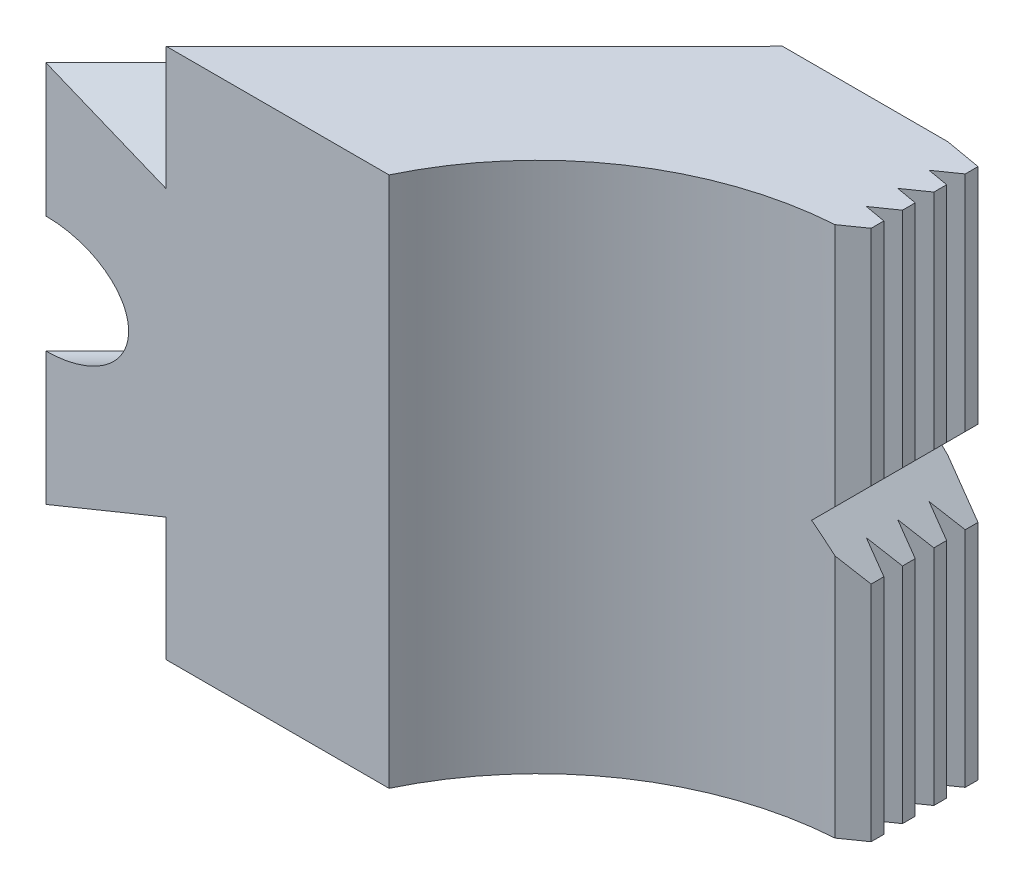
ISO-10303-21;
HEADER;
FILE_DESCRIPTION(('STEP AP214'),'2;1');
FILE_NAME('part.step','',(''),(''),'','','');
FILE_SCHEMA(('AUTOMOTIVE_DESIGN { 1 0 10303 214 1 1 1 1 }'));
ENDSEC;
DATA;
#1=APPLICATION_CONTEXT('core data for automotive mechanical design processes');
#2=APPLICATION_PROTOCOL_DEFINITION('international standard','automotive_design',2000,#1);
#3=PRODUCT_CONTEXT('',#1,'mechanical');
#4=PRODUCT('Part','Part','',(#3));
#5=PRODUCT_RELATED_PRODUCT_CATEGORY('part','',(#4));
#6=PRODUCT_DEFINITION_FORMATION('','',#4);
#7=PRODUCT_DEFINITION_CONTEXT('part definition',#1,'design');
#8=PRODUCT_DEFINITION('design','',#6,#7);
#9=PRODUCT_DEFINITION_SHAPE('','',#8);
#10=(LENGTH_UNIT() NAMED_UNIT(*) SI_UNIT(.MILLI.,.METRE.));
#11=(NAMED_UNIT(*) PLANE_ANGLE_UNIT() SI_UNIT($,.RADIAN.));
#12=(NAMED_UNIT(*) SI_UNIT($,.STERADIAN.) SOLID_ANGLE_UNIT());
#13=UNCERTAINTY_MEASURE_WITH_UNIT(LENGTH_MEASURE(1.E-05),#10,'distance_accuracy_value','');
#14=(GEOMETRIC_REPRESENTATION_CONTEXT(3) GLOBAL_UNCERTAINTY_ASSIGNED_CONTEXT((#13)) GLOBAL_UNIT_ASSIGNED_CONTEXT((#10,
#11,#12)) REPRESENTATION_CONTEXT('',''));
#15=CARTESIAN_POINT('',(0.,0.,0.));
#16=DIRECTION('',(0.,0.,1.));
#17=DIRECTION('',(1.,0.,0.));
#18=AXIS2_PLACEMENT_3D('',#15,#16,#17);
#19=CARTESIAN_POINT('',(-5.99555582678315,1.78618718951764,8.15520176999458));
#20=DIRECTION('',(0.707106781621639,1.45030515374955E-10,-0.707106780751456));
#21=DIRECTION('',(0.666666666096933,0.333333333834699,0.666666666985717));
#22=AXIS2_PLACEMENT_3D('',#19,#20,#21);
#23=PLANE('',#22);
#24=DIRECTION('',(-0.695201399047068,0.182729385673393,-0.695201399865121));
#25=VECTOR('',#24,1.);
#26=CARTESIAN_POINT('',(-5.99555582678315,1.78618718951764,8.15520176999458));
#27=LINE('',#26,#25);
#28=CARTESIAN_POINT('',(-5.99555582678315,1.78618718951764,8.15520176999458));
#29=VERTEX_POINT('',#28);
#30=CARTESIAN_POINT('',(-7.62927911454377,2.21560124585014,6.52147848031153));
#31=VERTEX_POINT('',#30);
#32=EDGE_CURVE('E371',#29,#31,#27,.T.);
#33=ORIENTED_EDGE('',*,*,#32,.T.);
#34=DIRECTION('',(-0.459499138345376,-0.760079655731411,-0.459499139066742));
#35=VECTOR('',#34,1.);
#36=CARTESIAN_POINT('',(-7.62927911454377,2.21560124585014,6.52147848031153));
#37=LINE('',#36,#35);
#38=CARTESIAN_POINT('',(-8.70910208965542,0.42941405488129,5.44165550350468));
#39=VERTEX_POINT('',#38);
#40=EDGE_CURVE('E374',#31,#39,#37,.T.);
#41=ORIENTED_EDGE('',*,*,#40,.T.);
#42=DIRECTION('',(0.235702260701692,-0.942809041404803,0.235702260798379));
#43=VECTOR('',#42,1.);
#44=CARTESIAN_POINT('',(-8.70910208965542,0.42941405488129,5.44165550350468));
#45=LINE('',#44,#43);
#46=CARTESIAN_POINT('',(-8.15520177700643,-1.78618719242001,5.99555581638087));
#47=VERTEX_POINT('',#46);
#48=EDGE_CURVE('E377',#39,#47,#45,.T.);
#49=ORIENTED_EDGE('',*,*,#48,.T.);
#50=DIRECTION('',(0.695201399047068,-0.182729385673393,0.695201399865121));
#51=VECTOR('',#50,1.);
#52=CARTESIAN_POINT('',(-8.15520177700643,-1.78618719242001,5.99555581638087));
#53=LINE('',#52,#51);
#54=CARTESIAN_POINT('',(-6.52147848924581,-2.21560124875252,7.62927910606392));
#55=VERTEX_POINT('',#54);
#56=EDGE_CURVE('E380',#47,#55,#53,.T.);
#57=ORIENTED_EDGE('',*,*,#56,.T.);
#58=DIRECTION('',(0.459499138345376,0.76007965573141,0.459499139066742));
#59=VECTOR('',#58,1.);
#60=CARTESIAN_POINT('',(-6.52147848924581,-2.21560124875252,7.62927910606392));
#61=LINE('',#60,#59);
#62=CARTESIAN_POINT('',(-5.44165551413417,-0.429414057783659,8.70910208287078));
#63=VERTEX_POINT('',#62);
#64=EDGE_CURVE('E383',#55,#63,#61,.T.);
#65=ORIENTED_EDGE('',*,*,#64,.T.);
#66=DIRECTION('',(-0.235702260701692,0.942809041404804,-0.235702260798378));
#67=VECTOR('',#66,1.);
#68=CARTESIAN_POINT('',(-5.44165551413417,-0.429414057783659,8.70910208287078));
#69=LINE('',#68,#67);
#70=EDGE_CURVE('E386',#63,#29,#69,.T.);
#71=ORIENTED_EDGE('',*,*,#70,.T.);
#72=EDGE_LOOP('',(#33,#41,#49,#57,#65,#71));
#73=FACE_BOUND('',#72,.T.);
#74=ADVANCED_FACE('F14',(#73),#23,.F.);
#75=CARTESIAN_POINT('',(-7.62927911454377,2.21560124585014,6.52147848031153));
#76=DIRECTION('',(-0.537457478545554,0.649829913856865,-0.537457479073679));
#77=DIRECTION('',(-0.459499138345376,-0.760079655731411,-0.459499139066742));
#78=AXIS2_PLACEMENT_3D('',#75,#76,#77);
#79=PLANE('',#78);
#80=DIRECTION('',(-0.459499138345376,-0.760079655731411,-0.459499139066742));
#81=VECTOR('',#80,1.);
#82=CARTESIAN_POINT('',(-10.4577062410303,2.21560124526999,9.34990560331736));
#83=LINE('',#82,#81);
#84=CARTESIAN_POINT('',(-10.4577062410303,2.21560124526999,9.34990560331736));
#85=VERTEX_POINT('',#84);
#86=CARTESIAN_POINT('',(-11.537529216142,0.429414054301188,8.27008262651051));
#87=VERTEX_POINT('',#86);
#88=EDGE_CURVE('E356',#85,#87,#83,.T.);
#89=ORIENTED_EDGE('',*,*,#88,.T.);
#90=DIRECTION('',(-0.707106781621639,-1.45030515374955E-10,0.707106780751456));
#91=VECTOR('',#90,1.);
#92=CARTESIAN_POINT('',(-8.70910208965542,0.42941405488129,5.44165550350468));
#93=LINE('',#92,#91);
#94=EDGE_CURVE('E399',#39,#87,#93,.T.);
#95=ORIENTED_EDGE('',*,*,#94,.F.);
#96=ORIENTED_EDGE('',*,*,#40,.F.);
#97=DIRECTION('',(-0.707106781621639,-1.45030515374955E-10,0.707106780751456));
#98=VECTOR('',#97,1.);
#99=CARTESIAN_POINT('',(-7.62927911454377,2.21560124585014,6.52147848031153));
#100=LINE('',#99,#98);
#101=EDGE_CURVE('E389',#31,#85,#100,.T.);
#102=ORIENTED_EDGE('',*,*,#101,.T.);
#103=EDGE_LOOP('',(#89,#95,#96,#102));
#104=FACE_BOUND('',#103,.T.);
#105=ADVANCED_FACE('F425',(#104),#79,.F.);
#106=CARTESIAN_POINT('',(-8.70910208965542,0.42941405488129,5.44165550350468));
#107=DIRECTION('',(-0.666666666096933,-0.3333333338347,-0.666666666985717));
#108=DIRECTION('',(0.235702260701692,-0.942809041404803,0.235702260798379));
#109=AXIS2_PLACEMENT_3D('',#106,#107,#108);
#110=PLANE('',#109);
#111=DIRECTION('',(0.235702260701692,-0.942809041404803,0.235702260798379));
#112=VECTOR('',#111,1.);
#113=CARTESIAN_POINT('',(-11.537529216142,0.429414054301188,8.27008262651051));
#114=LINE('',#113,#112);
#115=CARTESIAN_POINT('',(-10.983628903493,-1.78618719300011,8.8239829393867));
#116=VERTEX_POINT('',#115);
#117=EDGE_CURVE('E359',#87,#116,#114,.T.);
#118=ORIENTED_EDGE('',*,*,#117,.T.);
#119=DIRECTION('',(-0.707106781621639,-1.45030515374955E-10,0.707106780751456));
#120=VECTOR('',#119,1.);
#121=CARTESIAN_POINT('',(-8.15520177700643,-1.78618719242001,5.99555581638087));
#122=LINE('',#121,#120);
#123=EDGE_CURVE('E397',#47,#116,#122,.T.);
#124=ORIENTED_EDGE('',*,*,#123,.F.);
#125=ORIENTED_EDGE('',*,*,#48,.F.);
#126=ORIENTED_EDGE('',*,*,#94,.T.);
#127=EDGE_LOOP('',(#118,#124,#125,#126));
#128=FACE_BOUND('',#127,.T.);
#129=ADVANCED_FACE('F432',(#128),#110,.F.);
#130=CARTESIAN_POINT('',(-8.15520177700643,-1.78618719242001,5.99555581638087));
#131=DIRECTION('',(-0.129209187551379,-0.983163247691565,-0.129209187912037));
#132=DIRECTION('',(0.695201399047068,-0.182729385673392,0.695201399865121));
#133=AXIS2_PLACEMENT_3D('',#130,#131,#132);
#134=PLANE('',#133);
#135=DIRECTION('',(0.695201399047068,-0.182729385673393,0.695201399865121));
#136=VECTOR('',#135,1.);
#137=CARTESIAN_POINT('',(-10.983628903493,-1.78618719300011,8.8239829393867));
#138=LINE('',#137,#136);
#139=CARTESIAN_POINT('',(-9.34990561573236,-2.21560124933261,10.4577062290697));
#140=VERTEX_POINT('',#139);
#141=EDGE_CURVE('E362',#116,#140,#138,.T.);
#142=ORIENTED_EDGE('',*,*,#141,.T.);
#143=DIRECTION('',(-0.707106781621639,-1.45030515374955E-10,0.707106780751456));
#144=VECTOR('',#143,1.);
#145=CARTESIAN_POINT('',(-6.52147848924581,-2.21560124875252,7.62927910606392));
#146=LINE('',#145,#144);
#147=EDGE_CURVE('E395',#55,#140,#146,.T.);
#148=ORIENTED_EDGE('',*,*,#147,.F.);
#149=ORIENTED_EDGE('',*,*,#56,.F.);
#150=ORIENTED_EDGE('',*,*,#123,.T.);
#151=EDGE_LOOP('',(#142,#148,#149,#150));
#152=FACE_BOUND('',#151,.T.);
#153=ADVANCED_FACE('F444',(#152),#134,.F.);
#154=CARTESIAN_POINT('',(-6.52147848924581,-2.21560124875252,7.62927910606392));
#155=DIRECTION('',(0.537457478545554,-0.649829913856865,0.537457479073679));
#156=DIRECTION('',(0.459499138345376,0.760079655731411,0.459499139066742));
#157=AXIS2_PLACEMENT_3D('',#154,#155,#156);
#158=PLANE('',#157);
#159=DIRECTION('',(0.459499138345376,0.76007965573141,0.459499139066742));
#160=VECTOR('',#159,1.);
#161=CARTESIAN_POINT('',(-9.34990561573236,-2.21560124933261,10.4577062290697));
#162=LINE('',#161,#160);
#163=CARTESIAN_POINT('',(-8.27008264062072,-0.429414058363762,11.5375292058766));
#164=VERTEX_POINT('',#163);
#165=EDGE_CURVE('E365',#140,#164,#162,.T.);
#166=ORIENTED_EDGE('',*,*,#165,.T.);
#167=DIRECTION('',(-0.707106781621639,-1.45030515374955E-10,0.707106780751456));
#168=VECTOR('',#167,1.);
#169=CARTESIAN_POINT('',(-5.44165551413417,-0.429414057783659,8.70910208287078));
#170=LINE('',#169,#168);
#171=EDGE_CURVE('E393',#63,#164,#170,.T.);
#172=ORIENTED_EDGE('',*,*,#171,.F.);
#173=ORIENTED_EDGE('',*,*,#64,.F.);
#174=ORIENTED_EDGE('',*,*,#147,.T.);
#175=EDGE_LOOP('',(#166,#172,#173,#174));
#176=FACE_BOUND('',#175,.T.);
#177=ADVANCED_FACE('F440',(#176),#158,.F.);
#178=CARTESIAN_POINT('',(-5.44165551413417,-0.429414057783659,8.70910208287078));
#179=DIRECTION('',(0.666666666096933,0.333333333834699,0.666666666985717));
#180=DIRECTION('',(-0.707106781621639,-1.45030515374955E-10,0.707106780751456));
#181=AXIS2_PLACEMENT_3D('',#178,#179,#180);
#182=PLANE('',#181);
#183=DIRECTION('',(-0.235702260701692,0.942809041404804,-0.235702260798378));
#184=VECTOR('',#183,1.);
#185=CARTESIAN_POINT('',(-8.27008264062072,-0.429414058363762,11.5375292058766));
#186=LINE('',#185,#184);
#187=CARTESIAN_POINT('',(-8.8239829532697,1.78618718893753,10.9836288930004));
#188=VERTEX_POINT('',#187);
#189=EDGE_CURVE('E368',#164,#188,#186,.T.);
#190=ORIENTED_EDGE('',*,*,#189,.T.);
#191=DIRECTION('',(-0.707106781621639,-1.45030515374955E-10,0.707106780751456));
#192=VECTOR('',#191,1.);
#193=CARTESIAN_POINT('',(-5.99555582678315,1.78618718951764,8.15520176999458));
#194=LINE('',#193,#192);
#195=EDGE_CURVE('E390',#29,#188,#194,.T.);
#196=ORIENTED_EDGE('',*,*,#195,.F.);
#197=ORIENTED_EDGE('',*,*,#70,.F.);
#198=ORIENTED_EDGE('',*,*,#171,.T.);
#199=EDGE_LOOP('',(#190,#196,#197,#198));
#200=FACE_BOUND('',#199,.T.);
#201=ADVANCED_FACE('F421',(#200),#182,.F.);
#202=CARTESIAN_POINT('',(-5.99555582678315,1.78618718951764,8.15520176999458));
#203=DIRECTION('',(0.129209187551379,0.983163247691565,0.129209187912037));
#204=DIRECTION('',(-0.695201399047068,0.182729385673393,-0.695201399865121));
#205=AXIS2_PLACEMENT_3D('',#202,#203,#204);
#206=PLANE('',#205);
#207=DIRECTION('',(-0.695201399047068,0.182729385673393,-0.695201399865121));
#208=VECTOR('',#207,1.);
#209=CARTESIAN_POINT('',(-8.8239829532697,1.78618718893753,10.9836288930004));
#210=LINE('',#209,#208);
#211=EDGE_CURVE('E354',#188,#85,#210,.T.);
#212=ORIENTED_EDGE('',*,*,#211,.T.);
#213=ORIENTED_EDGE('',*,*,#101,.F.);
#214=ORIENTED_EDGE('',*,*,#32,.F.);
#215=ORIENTED_EDGE('',*,*,#195,.T.);
#216=EDGE_LOOP('',(#212,#213,#214,#215));
#217=FACE_BOUND('',#216,.T.);
#218=ADVANCED_FACE('F413',(#217),#206,.F.);
#219=CARTESIAN_POINT('',(-2.83273811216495,-5.81010933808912E-10,2.83273810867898));
#220=DIRECTION('',(-0.707106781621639,-1.45030515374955E-10,0.707106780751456));
#221=DIRECTION('',(-0.666666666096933,-0.333333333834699,-0.666666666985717));
#222=AXIS2_PLACEMENT_3D('',#219,#220,#221);
#223=PLANE('',#222);
#224=CARTESIAN_POINT('',(-2.83273811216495,-5.81010933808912E-10,2.83273810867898));
#225=DIRECTION('',(-0.707106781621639,-1.45030515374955E-10,0.707106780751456));
#226=DIRECTION('',(-0.666666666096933,-0.333333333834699,-0.666666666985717));
#227=AXIS2_PLACEMENT_3D('',#224,#225,#226);
#228=CIRCLE('',#227,5.);
#229=CARTESIAN_POINT('',(-2.83273811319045,4.99999999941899,2.83273810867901));
#230=VERTEX_POINT('',#229);
#231=CARTESIAN_POINT('',(-2.83273811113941,-5.00000000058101,2.832738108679));
#232=VERTEX_POINT('',#231);
#233=EDGE_CURVE('E392',#230,#232,#228,.T.);
#234=ORIENTED_EDGE('',*,*,#233,.F.);
#235=DIRECTION('',(2.05103737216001E-10,-1.,0.));
#236=VECTOR('',#235,1.);
#237=CARTESIAN_POINT('',(-2.83273810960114,-12.500000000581,2.83273810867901));
#238=LINE('',#237,#236);
#239=EDGE_CURVE('E341',#230,#232,#238,.T.);
#240=ORIENTED_EDGE('',*,*,#239,.T.);
#241=EDGE_LOOP('',(#234,#240));
#242=FACE_BOUND('',#241,.T.);
#243=ADVANCED_FACE('F411',(#242),#223,.F.);
#244=CARTESIAN_POINT('',(-9.90380592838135,-2.03131261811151E-09,9.90380591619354));
#245=DIRECTION('',(-0.707106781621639,-1.45030515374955E-10,0.707106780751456));
#246=DIRECTION('',(-0.666666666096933,-0.333333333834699,-0.666666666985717));
#247=AXIS2_PLACEMENT_3D('',#244,#245,#246);
#248=PLANE('',#247);
#249=DIRECTION('',(2.05103737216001E-10,-1.,0.));
#250=VECTOR('',#249,1.);
#251=CARTESIAN_POINT('',(-9.90380592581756,-12.5000000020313,9.90380591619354));
#252=LINE('',#251,#250);
#253=CARTESIAN_POINT('',(-9.90380592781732,-2.75000000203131,9.90380591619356));
#254=VERTEX_POINT('',#253);
#255=CARTESIAN_POINT('',(-9.90380592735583,-5.00000000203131,9.90380591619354));
#256=VERTEX_POINT('',#255);
#257=EDGE_CURVE('E31',#254,#256,#252,.T.);
#258=ORIENTED_EDGE('',*,*,#257,.F.);
#259=CARTESIAN_POINT('',(-9.90380592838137,-2.03131261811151E-09,9.90380591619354));
#260=DIRECTION('',(-0.707106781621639,-1.45030328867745E-10,0.707106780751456));
#261=DIRECTION('',(0.707106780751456,1.45030315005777E-10,0.707106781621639));
#262=AXIS2_PLACEMENT_3D('',#259,#260,#261);
#263=CIRCLE('',#262,2.75);
#264=CARTESIAN_POINT('',(-9.90380592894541,2.74999999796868,9.90380591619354));
#265=VERTEX_POINT('',#264);
#266=EDGE_CURVE('E872',#254,#265,#263,.T.);
#267=ORIENTED_EDGE('',*,*,#266,.T.);
#268=CARTESIAN_POINT('',(-9.90380592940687,4.99999999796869,9.90380591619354));
#269=VERTEX_POINT('',#268);
#270=EDGE_CURVE('E39',#269,#265,#252,.T.);
#271=ORIENTED_EDGE('',*,*,#270,.F.);
#272=CARTESIAN_POINT('',(-9.90380592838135,-2.03131261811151E-09,9.90380591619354));
#273=DIRECTION('',(-0.707106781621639,-1.45030515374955E-10,0.707106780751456));
#274=DIRECTION('',(-0.666666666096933,-0.333333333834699,-0.666666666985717));
#275=AXIS2_PLACEMENT_3D('',#272,#273,#274);
#276=CIRCLE('',#275,5.);
#277=EDGE_CURVE('E18',#269,#256,#276,.T.);
#278=ORIENTED_EDGE('',*,*,#277,.T.);
#279=EDGE_LOOP('',(#258,#267,#271,#278));
#280=FACE_BOUND('',#279,.T.);
#281=ORIENTED_EDGE('',*,*,#211,.F.);
#282=ORIENTED_EDGE('',*,*,#189,.F.);
#283=ORIENTED_EDGE('',*,*,#165,.F.);
#284=ORIENTED_EDGE('',*,*,#141,.F.);
#285=ORIENTED_EDGE('',*,*,#117,.F.);
#286=ORIENTED_EDGE('',*,*,#88,.F.);
#287=EDGE_LOOP('',(#281,#282,#283,#284,#285,#286));
#288=FACE_BOUND('',#287,.T.);
#289=ADVANCED_FACE('F407',(#280,#288),#248,.T.);
#290=CARTESIAN_POINT('',(-9.90380592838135,-2.03131261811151E-09,9.90380591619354));
#291=DIRECTION('',(0.707106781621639,1.45030515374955E-10,-0.707106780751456));
#292=DIRECTION('',(0.666666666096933,0.333333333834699,0.666666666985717));
#293=AXIS2_PLACEMENT_3D('',#290,#291,#292);
#294=CYLINDRICAL_SURFACE('',#293,5.);
#295=DIRECTION('',(-0.707106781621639,-1.45030328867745E-10,0.707106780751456));
#296=VECTOR('',#295,1.);
#297=CARTESIAN_POINT('',(-2.83273811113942,-5.00000000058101,2.83273810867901));
#298=LINE('',#297,#296);
#299=EDGE_CURVE('E9',#256,#232,#298,.F.);
#300=ORIENTED_EDGE('',*,*,#299,.F.);
#301=ORIENTED_EDGE('',*,*,#277,.F.);
#302=DIRECTION('',(-0.707106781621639,-1.45030328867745E-10,0.707106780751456));
#303=VECTOR('',#302,1.);
#304=CARTESIAN_POINT('',(-2.83273811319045,4.99999999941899,2.83273810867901));
#305=LINE('',#304,#303);
#306=EDGE_CURVE('E23',#230,#269,#305,.T.);
#307=ORIENTED_EDGE('',*,*,#306,.F.);
#308=ORIENTED_EDGE('',*,*,#233,.T.);
#309=EDGE_LOOP('',(#300,#301,#307,#308));
#310=FACE_BOUND('',#309,.T.);
#311=ADVANCED_FACE('F16',(#310),#294,.T.);
#312=CARTESIAN_POINT('',(15.1599999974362,12.5000000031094,9.32810079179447E-09));
#313=DIRECTION('',(-1.,-2.05103893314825E-10,-6.15310263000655E-10));
#314=DIRECTION('',(2.05103782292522E-10,-1.,0.));
#315=AXIS2_PLACEMENT_3D('',#312,#313,#314);
#316=PLANE('',#315);
#317=DIRECTION('',(6.15310540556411E-10,0.,-1.));
#318=VECTOR('',#317,1.);
#319=CARTESIAN_POINT('',(15.1599999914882,-1.99999999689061,14.5000000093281));
#320=LINE('',#319,#318);
#321=CARTESIAN_POINT('',(15.1599999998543,-1.99999999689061,0.90355936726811));
#322=VERTEX_POINT('',#321);
#323=CARTESIAN_POINT('',(15.1600000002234,-1.99999999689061,0.303559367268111));
#324=VERTEX_POINT('',#323);
#325=EDGE_CURVE('E885',#322,#324,#320,.T.);
#326=ORIENTED_EDGE('',*,*,#325,.F.);
#327=DIRECTION('',(-2.05103782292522E-10,1.,0.));
#328=VECTOR('',#327,1.);
#329=CARTESIAN_POINT('',(15.1600000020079,-12.4999999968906,0.90355936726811));
#330=LINE('',#329,#328);
#331=CARTESIAN_POINT('',(15.1600000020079,-12.4999999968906,0.90355936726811));
#332=VERTEX_POINT('',#331);
#333=EDGE_CURVE('E1011',#332,#322,#330,.T.);
#334=ORIENTED_EDGE('',*,*,#333,.F.);
#335=DIRECTION('',(6.15310540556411E-10,0.,-1.));
#336=VECTOR('',#335,1.);
#337=CARTESIAN_POINT('',(15.1600000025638,-12.4999999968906,9.32809558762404E-09));
#338=LINE('',#337,#336);
#339=CARTESIAN_POINT('',(15.160000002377,-12.4999999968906,0.303559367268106));
#340=VERTEX_POINT('',#339);
#341=EDGE_CURVE('E1034',#332,#340,#338,.T.);
#342=ORIENTED_EDGE('',*,*,#341,.T.);
#343=DIRECTION('',(-2.05103782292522E-10,1.,0.));
#344=VECTOR('',#343,1.);
#345=CARTESIAN_POINT('',(15.160000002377,-12.4999999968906,0.303559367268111));
#346=LINE('',#345,#344);
#347=EDGE_CURVE('E1015',#340,#324,#346,.T.);
#348=ORIENTED_EDGE('',*,*,#347,.T.);
#349=EDGE_LOOP('',(#326,#334,#342,#348));
#350=FACE_BOUND('',#349,.T.);
#351=ADVANCED_FACE('F524',(#350),#316,.F.);
#352=CARTESIAN_POINT('',(14.160000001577,-12.4999999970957,1.60376690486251));
#353=DIRECTION('',(-0.573576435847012,-1.17642715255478E-10,-0.81915204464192));
#354=DIRECTION('',(-0.81915204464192,-1.68011304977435E-10,0.573576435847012));
#355=AXIS2_PLACEMENT_3D('',#352,#353,#354);
#356=PLANE('',#355);
#357=DIRECTION('',(0.633687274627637,-0.633687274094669,-0.443712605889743));
#358=VECTOR('',#357,1.);
#359=CARTESIAN_POINT('',(18.777934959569,-5.61793495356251,-1.6297459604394));
#360=LINE('',#359,#358);
#361=CARTESIAN_POINT('',(14.1599999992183,-0.999999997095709,1.60376690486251));
#362=VERTEX_POINT('',#361);
#363=EDGE_CURVE('E904',#362,#322,#360,.T.);
#364=ORIENTED_EDGE('',*,*,#363,.F.);
#365=DIRECTION('',(-2.05103782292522E-10,1.,0.));
#366=VECTOR('',#365,1.);
#367=CARTESIAN_POINT('',(14.160000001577,-12.4999999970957,1.60376690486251));
#368=LINE('',#367,#366);
#369=CARTESIAN_POINT('',(14.160000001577,-12.4999999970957,1.60376690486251));
#370=VERTEX_POINT('',#369);
#371=EDGE_CURVE('E1007',#370,#362,#368,.T.);
#372=ORIENTED_EDGE('',*,*,#371,.F.);
#373=DIRECTION('',(-0.81915204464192,-1.68011304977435E-10,0.573576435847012));
#374=VECTOR('',#373,1.);
#375=CARTESIAN_POINT('',(14.160000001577,-12.4999999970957,1.60376690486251));
#376=LINE('',#375,#374);
#377=EDGE_CURVE('E959',#332,#370,#376,.T.);
#378=ORIENTED_EDGE('',*,*,#377,.F.);
#379=ORIENTED_EDGE('',*,*,#333,.T.);
#380=EDGE_LOOP('',(#364,#372,#378,#379));
#381=FACE_BOUND('',#380,.T.);
#382=ADVANCED_FACE('F530',(#381),#356,.F.);
#383=CARTESIAN_POINT('',(15.1600000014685,-12.4999999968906,1.78009388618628));
#384=DIRECTION('',(-0.173648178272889,-3.56159713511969E-11,0.984807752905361));
#385=DIRECTION('',(0.984807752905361,2.01987894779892E-10,0.173648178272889));
#386=AXIS2_PLACEMENT_3D('',#383,#384,#385);
#387=PLANE('',#386);
#388=DIRECTION('',(-0.701673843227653,0.701673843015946,-0.123724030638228));
#389=VECTOR('',#388,1.);
#390=CARTESIAN_POINT('',(20.329634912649,-7.16963490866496,2.6916400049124));
#391=LINE('',#390,#389);
#392=CARTESIAN_POINT('',(15.1599999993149,-1.99999999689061,1.78009388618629));
#393=VERTEX_POINT('',#392);
#394=EDGE_CURVE('E902',#393,#362,#391,.T.);
#395=ORIENTED_EDGE('',*,*,#394,.F.);
#396=DIRECTION('',(-2.05103782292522E-10,1.,0.));
#397=VECTOR('',#396,1.);
#398=CARTESIAN_POINT('',(15.1600000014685,-12.4999999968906,1.78009388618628));
#399=LINE('',#398,#397);
#400=CARTESIAN_POINT('',(15.1600000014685,-12.4999999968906,1.78009388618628));
#401=VERTEX_POINT('',#400);
#402=EDGE_CURVE('E1003',#401,#393,#399,.T.);
#403=ORIENTED_EDGE('',*,*,#402,.F.);
#404=DIRECTION('',(0.984807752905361,2.01987894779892E-10,0.173648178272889));
#405=VECTOR('',#404,1.);
#406=CARTESIAN_POINT('',(15.1600000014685,-12.4999999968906,1.78009388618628));
#407=LINE('',#406,#405);
#408=EDGE_CURVE('E962',#370,#401,#407,.T.);
#409=ORIENTED_EDGE('',*,*,#408,.F.);
#410=ORIENTED_EDGE('',*,*,#371,.T.);
#411=EDGE_LOOP('',(#395,#403,#409,#410));
#412=FACE_BOUND('',#411,.T.);
#413=ADVANCED_FACE('F542',(#412),#387,.F.);
#414=CARTESIAN_POINT('',(15.1599999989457,-1.99999999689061,2.38009388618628));
#415=VERTEX_POINT('',#414);
#416=EDGE_CURVE('E887',#415,#393,#320,.T.);
#417=ORIENTED_EDGE('',*,*,#416,.F.);
#418=DIRECTION('',(-2.05103782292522E-10,1.,0.));
#419=VECTOR('',#418,1.);
#420=CARTESIAN_POINT('',(15.1600000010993,-12.4999999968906,2.38009388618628));
#421=LINE('',#420,#419);
#422=CARTESIAN_POINT('',(15.1600000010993,-12.4999999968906,2.38009388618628));
#423=VERTEX_POINT('',#422);
#424=EDGE_CURVE('E999',#423,#415,#421,.T.);
#425=ORIENTED_EDGE('',*,*,#424,.F.);
#426=EDGE_CURVE('E1037',#423,#401,#338,.T.);
#427=ORIENTED_EDGE('',*,*,#426,.T.);
#428=ORIENTED_EDGE('',*,*,#402,.T.);
#429=EDGE_LOOP('',(#417,#425,#427,#428));
#430=FACE_BOUND('',#429,.T.);
#431=ADVANCED_FACE('F553',(#430),#316,.F.);
#432=CARTESIAN_POINT('',(14.1600000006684,-12.4999999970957,3.08030142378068));
#433=DIRECTION('',(-0.573576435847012,-1.17642715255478E-10,-0.819152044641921));
#434=DIRECTION('',(-0.819152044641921,-1.68011304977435E-10,0.573576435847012));
#435=AXIS2_PLACEMENT_3D('',#432,#433,#434);
#436=PLANE('',#435);
#437=DIRECTION('',(0.633687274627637,-0.633687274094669,-0.443712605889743));
#438=VECTOR('',#437,1.);
#439=CARTESIAN_POINT('',(18.7779349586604,-5.61793495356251,-0.15321144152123));
#440=LINE('',#439,#438);
#441=CARTESIAN_POINT('',(14.1599999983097,-0.999999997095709,3.08030142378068));
#442=VERTEX_POINT('',#441);
#443=EDGE_CURVE('E900',#442,#415,#440,.T.);
#444=ORIENTED_EDGE('',*,*,#443,.F.);
#445=DIRECTION('',(-2.05103782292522E-10,1.,0.));
#446=VECTOR('',#445,1.);
#447=CARTESIAN_POINT('',(14.1600000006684,-12.4999999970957,3.08030142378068));
#448=LINE('',#447,#446);
#449=CARTESIAN_POINT('',(14.1600000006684,-12.4999999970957,3.08030142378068));
#450=VERTEX_POINT('',#449);
#451=EDGE_CURVE('E995',#450,#442,#448,.T.);
#452=ORIENTED_EDGE('',*,*,#451,.F.);
#453=DIRECTION('',(-0.819152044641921,-1.68011304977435E-10,0.573576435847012));
#454=VECTOR('',#453,1.);
#455=CARTESIAN_POINT('',(14.1600000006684,-12.4999999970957,3.08030142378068));
#456=LINE('',#455,#454);
#457=EDGE_CURVE('E965',#423,#450,#456,.T.);
#458=ORIENTED_EDGE('',*,*,#457,.F.);
#459=ORIENTED_EDGE('',*,*,#424,.T.);
#460=EDGE_LOOP('',(#444,#452,#458,#459));
#461=FACE_BOUND('',#460,.T.);
#462=ADVANCED_FACE('F563',(#461),#436,.F.);
#463=CARTESIAN_POINT('',(15.1600000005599,-12.4999999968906,3.25662840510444));
#464=DIRECTION('',(-0.173648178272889,-3.56159713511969E-11,0.984807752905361));
#465=DIRECTION('',(0.984807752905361,2.01987894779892E-10,0.173648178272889));
#466=AXIS2_PLACEMENT_3D('',#463,#464,#465);
#467=PLANE('',#466);
#468=DIRECTION('',(-0.701673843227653,0.701673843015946,-0.123724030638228));
#469=VECTOR('',#468,1.);
#470=CARTESIAN_POINT('',(20.3296349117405,-7.16963490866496,4.16817452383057));
#471=LINE('',#470,#469);
#472=CARTESIAN_POINT('',(15.1599999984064,-1.99999999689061,3.25662840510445));
#473=VERTEX_POINT('',#472);
#474=EDGE_CURVE('E898',#473,#442,#471,.T.);
#475=ORIENTED_EDGE('',*,*,#474,.F.);
#476=DIRECTION('',(-2.05103782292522E-10,1.,0.));
#477=VECTOR('',#476,1.);
#478=CARTESIAN_POINT('',(15.1600000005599,-12.4999999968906,3.25662840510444));
#479=LINE('',#478,#477);
#480=CARTESIAN_POINT('',(15.1600000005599,-12.4999999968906,3.25662840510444));
#481=VERTEX_POINT('',#480);
#482=EDGE_CURVE('E991',#481,#473,#479,.T.);
#483=ORIENTED_EDGE('',*,*,#482,.F.);
#484=DIRECTION('',(0.984807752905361,2.01987894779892E-10,0.173648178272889));
#485=VECTOR('',#484,1.);
#486=CARTESIAN_POINT('',(15.1600000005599,-12.4999999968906,3.25662840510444));
#487=LINE('',#486,#485);
#488=EDGE_CURVE('E968',#450,#481,#487,.T.);
#489=ORIENTED_EDGE('',*,*,#488,.F.);
#490=ORIENTED_EDGE('',*,*,#451,.T.);
#491=EDGE_LOOP('',(#475,#483,#489,#490));
#492=FACE_BOUND('',#491,.T.);
#493=ADVANCED_FACE('F573',(#492),#467,.F.);
#494=CARTESIAN_POINT('',(15.1599999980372,-1.99999999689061,3.85662840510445));
#495=VERTEX_POINT('',#494);
#496=EDGE_CURVE('E1140',#495,#473,#320,.T.);
#497=ORIENTED_EDGE('',*,*,#496,.F.);
#498=DIRECTION('',(-2.05103782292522E-10,1.,0.));
#499=VECTOR('',#498,1.);
#500=CARTESIAN_POINT('',(15.1600000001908,-12.4999999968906,3.85662840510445));
#501=LINE('',#500,#499);
#502=CARTESIAN_POINT('',(15.1600000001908,-12.4999999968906,3.85662840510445));
#503=VERTEX_POINT('',#502);
#504=EDGE_CURVE('E987',#503,#495,#501,.T.);
#505=ORIENTED_EDGE('',*,*,#504,.F.);
#506=EDGE_CURVE('E1128',#503,#481,#338,.T.);
#507=ORIENTED_EDGE('',*,*,#506,.T.);
#508=ORIENTED_EDGE('',*,*,#482,.T.);
#509=EDGE_LOOP('',(#497,#505,#507,#508));
#510=FACE_BOUND('',#509,.T.);
#511=ADVANCED_FACE('F583',(#510),#316,.F.);
#512=CARTESIAN_POINT('',(14.1599999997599,-12.4999999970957,4.55683594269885));
#513=DIRECTION('',(-0.573576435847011,-1.17642715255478E-10,-0.819152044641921));
#514=DIRECTION('',(-0.819152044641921,-1.68011304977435E-10,0.573576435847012));
#515=AXIS2_PLACEMENT_3D('',#512,#513,#514);
#516=PLANE('',#515);
#517=DIRECTION('',(0.633687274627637,-0.633687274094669,-0.443712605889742));
#518=VECTOR('',#517,1.);
#519=CARTESIAN_POINT('',(18.7779349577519,-5.61793495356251,1.32332307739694));
#520=LINE('',#519,#518);
#521=CARTESIAN_POINT('',(14.1599999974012,-0.999999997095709,4.55683594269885));
#522=VERTEX_POINT('',#521);
#523=EDGE_CURVE('E326',#522,#495,#520,.T.);
#524=ORIENTED_EDGE('',*,*,#523,.F.);
#525=DIRECTION('',(-2.05103782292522E-10,1.,0.));
#526=VECTOR('',#525,1.);
#527=CARTESIAN_POINT('',(14.1599999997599,-12.4999999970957,4.55683594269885));
#528=LINE('',#527,#526);
#529=CARTESIAN_POINT('',(14.1599999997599,-12.4999999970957,4.55683594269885));
#530=VERTEX_POINT('',#529);
#531=EDGE_CURVE('E983',#530,#522,#528,.T.);
#532=ORIENTED_EDGE('',*,*,#531,.F.);
#533=DIRECTION('',(-0.819152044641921,-1.68011304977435E-10,0.573576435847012));
#534=VECTOR('',#533,1.);
#535=CARTESIAN_POINT('',(14.1599999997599,-12.4999999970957,4.55683594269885));
#536=LINE('',#535,#534);
#537=EDGE_CURVE('E971',#503,#530,#536,.T.);
#538=ORIENTED_EDGE('',*,*,#537,.F.);
#539=ORIENTED_EDGE('',*,*,#504,.T.);
#540=EDGE_LOOP('',(#524,#532,#538,#539));
#541=FACE_BOUND('',#540,.T.);
#542=ADVANCED_FACE('F593',(#541),#516,.F.);
#543=CARTESIAN_POINT('',(15.1599999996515,-12.4999999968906,4.73316292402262));
#544=DIRECTION('',(-0.17364817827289,-3.56159713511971E-11,0.984807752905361));
#545=DIRECTION('',(0.984807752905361,2.01987894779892E-10,0.17364817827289));
#546=AXIS2_PLACEMENT_3D('',#543,#544,#545);
#547=PLANE('',#546);
#548=DIRECTION('',(-0.701673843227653,0.701673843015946,-0.123724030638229));
#549=VECTOR('',#548,1.);
#550=CARTESIAN_POINT('',(20.3296349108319,-7.16963490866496,5.64470904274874));
#551=LINE('',#550,#549);
#552=CARTESIAN_POINT('',(15.1599999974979,-1.99999999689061,4.73316292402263));
#553=VERTEX_POINT('',#552);
#554=EDGE_CURVE('E896',#553,#522,#551,.T.);
#555=ORIENTED_EDGE('',*,*,#554,.F.);
#556=DIRECTION('',(-2.05103782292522E-10,1.,0.));
#557=VECTOR('',#556,1.);
#558=CARTESIAN_POINT('',(15.1599999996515,-12.4999999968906,4.73316292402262));
#559=LINE('',#558,#557);
#560=CARTESIAN_POINT('',(15.1599999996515,-12.4999999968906,4.73316292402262));
#561=VERTEX_POINT('',#560);
#562=EDGE_CURVE('E978',#561,#553,#559,.T.);
#563=ORIENTED_EDGE('',*,*,#562,.F.);
#564=DIRECTION('',(0.984807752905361,2.01987894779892E-10,0.17364817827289));
#565=VECTOR('',#564,1.);
#566=CARTESIAN_POINT('',(15.1599999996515,-12.4999999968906,4.73316292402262));
#567=LINE('',#566,#565);
#568=EDGE_CURVE('E974',#530,#561,#567,.T.);
#569=ORIENTED_EDGE('',*,*,#568,.F.);
#570=ORIENTED_EDGE('',*,*,#531,.T.);
#571=EDGE_LOOP('',(#555,#563,#569,#570));
#572=FACE_BOUND('',#571,.T.);
#573=ADVANCED_FACE('F602',(#572),#547,.F.);
#574=CARTESIAN_POINT('',(15.1599999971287,-1.99999999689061,5.33316292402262));
#575=VERTEX_POINT('',#574);
#576=EDGE_CURVE('E888',#575,#553,#320,.T.);
#577=ORIENTED_EDGE('',*,*,#576,.F.);
#578=DIRECTION('',(-2.05103782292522E-10,1.,0.));
#579=VECTOR('',#578,1.);
#580=CARTESIAN_POINT('',(15.1599999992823,-12.4999999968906,5.33316292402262));
#581=LINE('',#580,#579);
#582=CARTESIAN_POINT('',(15.1599999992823,-12.4999999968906,5.33316292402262));
#583=VERTEX_POINT('',#582);
#584=EDGE_CURVE('E1027',#583,#575,#581,.T.);
#585=ORIENTED_EDGE('',*,*,#584,.F.);
#586=EDGE_CURVE('E1038',#583,#561,#338,.T.);
#587=ORIENTED_EDGE('',*,*,#586,.T.);
#588=ORIENTED_EDGE('',*,*,#562,.T.);
#589=EDGE_LOOP('',(#577,#585,#587,#588));
#590=FACE_BOUND('',#589,.T.);
#591=ADVANCED_FACE('F613',(#590),#316,.F.);
#592=CARTESIAN_POINT('',(15.1599999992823,-12.4999999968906,5.33316292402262));
#593=DIRECTION('',(-0.573576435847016,-1.17642715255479E-10,-0.819152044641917));
#594=DIRECTION('',(-0.819152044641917,-1.68011304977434E-10,0.573576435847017));
#595=AXIS2_PLACEMENT_3D('',#592,#593,#594);
#596=PLANE('',#595);
#597=DIRECTION('',(0.633687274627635,-0.633687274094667,-0.443712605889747));
#598=VECTOR('',#597,1.);
#599=CARTESIAN_POINT('',(19.3763753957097,-6.21637539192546,2.38082509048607));
#600=LINE('',#599,#598);
#601=CARTESIAN_POINT('',(14.1599999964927,-0.999999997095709,6.03337046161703));
#602=VERTEX_POINT('',#601);
#603=EDGE_CURVE('E908',#602,#575,#600,.T.);
#604=ORIENTED_EDGE('',*,*,#603,.F.);
#605=DIRECTION('',(-2.05103782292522E-10,1.,0.));
#606=VECTOR('',#605,1.);
#607=CARTESIAN_POINT('',(14.1599999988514,-12.4999999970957,6.03337046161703));
#608=LINE('',#607,#606);
#609=CARTESIAN_POINT('',(14.1599999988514,-12.4999999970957,6.03337046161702));
#610=VERTEX_POINT('',#609);
#611=EDGE_CURVE('E1023',#610,#602,#608,.T.);
#612=ORIENTED_EDGE('',*,*,#611,.F.);
#613=DIRECTION('',(-0.819152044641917,-1.68011304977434E-10,0.573576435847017));
#614=VECTOR('',#613,1.);
#615=CARTESIAN_POINT('',(15.1599999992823,-12.4999999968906,5.33316292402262));
#616=LINE('',#615,#614);
#617=EDGE_CURVE('E953',#583,#610,#616,.T.);
#618=ORIENTED_EDGE('',*,*,#617,.F.);
#619=ORIENTED_EDGE('',*,*,#584,.T.);
#620=EDGE_LOOP('',(#604,#612,#618,#619));
#621=FACE_BOUND('',#620,.T.);
#622=ADVANCED_FACE('F622',(#621),#596,.F.);
#623=DIRECTION('',(6.15310540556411E-10,0.,-1.));
#624=VECTOR('',#623,1.);
#625=CARTESIAN_POINT('',(15.1599999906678,2.00000000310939,14.5000000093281));
#626=LINE('',#625,#624);
#627=CARTESIAN_POINT('',(15.1599999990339,2.00000000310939,0.90355936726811));
#628=VERTEX_POINT('',#627);
#629=CARTESIAN_POINT('',(15.159999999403,2.00000000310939,0.303559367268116));
#630=VERTEX_POINT('',#629);
#631=EDGE_CURVE('E891',#628,#630,#626,.T.);
#632=ORIENTED_EDGE('',*,*,#631,.T.);
#633=CARTESIAN_POINT('',(15.1599999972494,12.5000000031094,0.303559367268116));
#634=VERTEX_POINT('',#633);
#635=EDGE_CURVE('E1018',#630,#634,#346,.T.);
#636=ORIENTED_EDGE('',*,*,#635,.T.);
#637=DIRECTION('',(6.15310540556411E-10,0.,-1.));
#638=VECTOR('',#637,1.);
#639=CARTESIAN_POINT('',(15.1599999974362,12.5000000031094,9.32810079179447E-09));
#640=LINE('',#639,#638);
#641=CARTESIAN_POINT('',(15.1599999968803,12.5000000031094,0.903559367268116));
#642=VERTEX_POINT('',#641);
#643=EDGE_CURVE('E1047',#642,#634,#640,.T.);
#644=ORIENTED_EDGE('',*,*,#643,.F.);
#645=EDGE_CURVE('E1014',#628,#642,#330,.T.);
#646=ORIENTED_EDGE('',*,*,#645,.F.);
#647=EDGE_LOOP('',(#632,#636,#644,#646));
#648=FACE_BOUND('',#647,.T.);
#649=ADVANCED_FACE('F534',(#648),#316,.F.);
#650=DIRECTION('',(-0.633687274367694,-0.633687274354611,0.443712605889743));
#651=VECTOR('',#650,1.);
#652=CARTESIAN_POINT('',(8.73894591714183,-4.42105407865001,5.39962983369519));
#653=LINE('',#652,#651);
#654=CARTESIAN_POINT('',(14.1599999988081,1.00000000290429,1.60376690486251));
#655=VERTEX_POINT('',#654);
#656=EDGE_CURVE('E920',#628,#655,#653,.T.);
#657=ORIENTED_EDGE('',*,*,#656,.F.);
#658=ORIENTED_EDGE('',*,*,#645,.T.);
#659=DIRECTION('',(-0.81915204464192,-1.68011304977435E-10,0.573576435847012));
#660=VECTOR('',#659,1.);
#661=CARTESIAN_POINT('',(14.1599999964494,12.5000000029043,1.60376690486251));
#662=LINE('',#661,#660);
#663=CARTESIAN_POINT('',(14.1599999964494,12.5000000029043,1.60376690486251));
#664=VERTEX_POINT('',#663);
#665=EDGE_CURVE('E935',#642,#664,#662,.T.);
#666=ORIENTED_EDGE('',*,*,#665,.T.);
#667=EDGE_CURVE('E1010',#655,#664,#368,.T.);
#668=ORIENTED_EDGE('',*,*,#667,.F.);
#669=EDGE_LOOP('',(#657,#658,#666,#668));
#670=FACE_BOUND('',#669,.T.);
#671=ADVANCED_FACE('F545',(#670),#356,.F.);
#672=DIRECTION('',(0.701673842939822,0.701673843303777,0.123724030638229));
#673=VECTOR('',#672,1.);
#674=CARTESIAN_POINT('',(8.02098035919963,-5.13901963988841,0.521292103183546));
#675=LINE('',#674,#673);
#676=CARTESIAN_POINT('',(15.1599999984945,2.00000000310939,1.78009388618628));
#677=VERTEX_POINT('',#676);
#678=EDGE_CURVE('E918',#655,#677,#675,.T.);
#679=ORIENTED_EDGE('',*,*,#678,.F.);
#680=ORIENTED_EDGE('',*,*,#667,.T.);
#681=DIRECTION('',(0.984807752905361,2.01987894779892E-10,0.173648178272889));
#682=VECTOR('',#681,1.);
#683=CARTESIAN_POINT('',(15.1599999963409,12.5000000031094,1.78009388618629));
#684=LINE('',#683,#682);
#685=CARTESIAN_POINT('',(15.1599999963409,12.5000000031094,1.78009388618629));
#686=VERTEX_POINT('',#685);
#687=EDGE_CURVE('E938',#664,#686,#684,.T.);
#688=ORIENTED_EDGE('',*,*,#687,.T.);
#689=EDGE_CURVE('E1006',#677,#686,#399,.T.);
#690=ORIENTED_EDGE('',*,*,#689,.F.);
#691=EDGE_LOOP('',(#679,#680,#688,#690));
#692=FACE_BOUND('',#691,.T.);
#693=ADVANCED_FACE('F546',(#692),#387,.F.);
#694=CARTESIAN_POINT('',(15.1599999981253,2.00000000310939,2.38009388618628));
#695=VERTEX_POINT('',#694);
#696=EDGE_CURVE('E894',#695,#677,#626,.T.);
#697=ORIENTED_EDGE('',*,*,#696,.T.);
#698=ORIENTED_EDGE('',*,*,#689,.T.);
#699=CARTESIAN_POINT('',(15.1599999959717,12.5000000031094,2.38009388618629));
#700=VERTEX_POINT('',#699);
#701=EDGE_CURVE('E1049',#700,#686,#640,.T.);
#702=ORIENTED_EDGE('',*,*,#701,.F.);
#703=EDGE_CURVE('E1002',#695,#700,#421,.T.);
#704=ORIENTED_EDGE('',*,*,#703,.F.);
#705=EDGE_LOOP('',(#697,#698,#702,#704));
#706=FACE_BOUND('',#705,.T.);
#707=ADVANCED_FACE('F565',(#706),#316,.F.);
#708=DIRECTION('',(-0.633687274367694,-0.633687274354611,0.443712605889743));
#709=VECTOR('',#708,1.);
#710=CARTESIAN_POINT('',(8.73894591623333,-4.42105407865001,6.87616435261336));
#711=LINE('',#710,#709);
#712=CARTESIAN_POINT('',(14.1599999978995,1.00000000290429,3.08030142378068));
#713=VERTEX_POINT('',#712);
#714=EDGE_CURVE('E916',#695,#713,#711,.T.);
#715=ORIENTED_EDGE('',*,*,#714,.F.);
#716=ORIENTED_EDGE('',*,*,#703,.T.);
#717=DIRECTION('',(-0.819152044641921,-1.68011304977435E-10,0.573576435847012));
#718=VECTOR('',#717,1.);
#719=CARTESIAN_POINT('',(14.1599999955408,12.5000000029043,3.08030142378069));
#720=LINE('',#719,#718);
#721=CARTESIAN_POINT('',(14.1599999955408,12.5000000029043,3.08030142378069));
#722=VERTEX_POINT('',#721);
#723=EDGE_CURVE('E941',#700,#722,#720,.T.);
#724=ORIENTED_EDGE('',*,*,#723,.T.);
#725=EDGE_CURVE('E998',#713,#722,#448,.T.);
#726=ORIENTED_EDGE('',*,*,#725,.F.);
#727=EDGE_LOOP('',(#715,#716,#724,#726));
#728=FACE_BOUND('',#727,.T.);
#729=ADVANCED_FACE('F556',(#728),#436,.F.);
#730=DIRECTION('',(0.701673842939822,0.701673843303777,0.123724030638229));
#731=VECTOR('',#730,1.);
#732=CARTESIAN_POINT('',(8.02098035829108,-5.13901963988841,1.99782662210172));
#733=LINE('',#732,#731);
#734=CARTESIAN_POINT('',(15.159999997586,2.00000000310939,3.25662840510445));
#735=VERTEX_POINT('',#734);
#736=EDGE_CURVE('E914',#713,#735,#733,.T.);
#737=ORIENTED_EDGE('',*,*,#736,.F.);
#738=ORIENTED_EDGE('',*,*,#725,.T.);
#739=DIRECTION('',(0.984807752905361,2.01987894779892E-10,0.173648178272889));
#740=VECTOR('',#739,1.);
#741=CARTESIAN_POINT('',(15.1599999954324,12.5000000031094,3.25662840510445));
#742=LINE('',#741,#740);
#743=CARTESIAN_POINT('',(15.1599999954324,12.5000000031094,3.25662840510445));
#744=VERTEX_POINT('',#743);
#745=EDGE_CURVE('E944',#722,#744,#742,.T.);
#746=ORIENTED_EDGE('',*,*,#745,.T.);
#747=EDGE_CURVE('E994',#735,#744,#479,.T.);
#748=ORIENTED_EDGE('',*,*,#747,.F.);
#749=EDGE_LOOP('',(#737,#738,#746,#748));
#750=FACE_BOUND('',#749,.T.);
#751=ADVANCED_FACE('F576',(#750),#467,.F.);
#752=CARTESIAN_POINT('',(15.1599999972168,2.00000000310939,3.85662840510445));
#753=VERTEX_POINT('',#752);
#754=EDGE_CURVE('E1110',#753,#735,#626,.T.);
#755=ORIENTED_EDGE('',*,*,#754,.T.);
#756=ORIENTED_EDGE('',*,*,#747,.T.);
#757=CARTESIAN_POINT('',(15.1599999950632,12.5000000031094,3.85662840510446));
#758=VERTEX_POINT('',#757);
#759=EDGE_CURVE('E1056',#758,#744,#640,.T.);
#760=ORIENTED_EDGE('',*,*,#759,.F.);
#761=EDGE_CURVE('E990',#753,#758,#501,.T.);
#762=ORIENTED_EDGE('',*,*,#761,.F.);
#763=EDGE_LOOP('',(#755,#756,#760,#762));
#764=FACE_BOUND('',#763,.T.);
#765=ADVANCED_FACE('F595',(#764),#316,.F.);
#766=DIRECTION('',(-0.633687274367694,-0.633687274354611,0.443712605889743));
#767=VECTOR('',#766,1.);
#768=CARTESIAN_POINT('',(8.73894591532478,-4.42105407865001,8.35269887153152));
#769=LINE('',#768,#767);
#770=CARTESIAN_POINT('',(14.159999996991,1.00000000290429,4.55683594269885));
#771=VERTEX_POINT('',#770);
#772=EDGE_CURVE('E333',#753,#771,#769,.T.);
#773=ORIENTED_EDGE('',*,*,#772,.F.);
#774=ORIENTED_EDGE('',*,*,#761,.T.);
#775=DIRECTION('',(-0.819152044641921,-1.68011304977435E-10,0.573576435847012));
#776=VECTOR('',#775,1.);
#777=CARTESIAN_POINT('',(14.1599999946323,12.5000000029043,4.55683594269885));
#778=LINE('',#777,#776);
#779=CARTESIAN_POINT('',(14.1599999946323,12.5000000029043,4.55683594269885));
#780=VERTEX_POINT('',#779);
#781=EDGE_CURVE('E947',#758,#780,#778,.T.);
#782=ORIENTED_EDGE('',*,*,#781,.T.);
#783=EDGE_CURVE('E986',#771,#780,#528,.T.);
#784=ORIENTED_EDGE('',*,*,#783,.F.);
#785=EDGE_LOOP('',(#773,#774,#782,#784));
#786=FACE_BOUND('',#785,.T.);
#787=ADVANCED_FACE('F605',(#786),#516,.F.);
#788=DIRECTION('',(0.701673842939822,0.701673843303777,0.123724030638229));
#789=VECTOR('',#788,1.);
#790=CARTESIAN_POINT('',(8.02098035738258,-5.13901963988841,3.47436114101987));
#791=LINE('',#790,#789);
#792=CARTESIAN_POINT('',(15.1599999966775,2.00000000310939,4.73316292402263));
#793=VERTEX_POINT('',#792);
#794=EDGE_CURVE('E912',#771,#793,#791,.T.);
#795=ORIENTED_EDGE('',*,*,#794,.F.);
#796=ORIENTED_EDGE('',*,*,#783,.T.);
#797=DIRECTION('',(0.984807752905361,2.01987894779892E-10,0.17364817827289));
#798=VECTOR('',#797,1.);
#799=CARTESIAN_POINT('',(15.1599999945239,12.5000000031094,4.73316292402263));
#800=LINE('',#799,#798);
#801=CARTESIAN_POINT('',(15.1599999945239,12.5000000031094,4.73316292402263));
#802=VERTEX_POINT('',#801);
#803=EDGE_CURVE('E950',#780,#802,#800,.T.);
#804=ORIENTED_EDGE('',*,*,#803,.T.);
#805=EDGE_CURVE('E982',#793,#802,#559,.T.);
#806=ORIENTED_EDGE('',*,*,#805,.F.);
#807=EDGE_LOOP('',(#795,#796,#804,#806));
#808=FACE_BOUND('',#807,.T.);
#809=ADVANCED_FACE('F586',(#808),#547,.F.);
#810=CARTESIAN_POINT('',(15.1599999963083,2.00000000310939,5.33316292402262));
#811=VERTEX_POINT('',#810);
#812=EDGE_CURVE('E895',#811,#793,#626,.T.);
#813=ORIENTED_EDGE('',*,*,#812,.T.);
#814=ORIENTED_EDGE('',*,*,#805,.T.);
#815=CARTESIAN_POINT('',(15.1599999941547,12.5000000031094,5.33316292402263));
#816=VERTEX_POINT('',#815);
#817=EDGE_CURVE('E1050',#816,#802,#640,.T.);
#818=ORIENTED_EDGE('',*,*,#817,.F.);
#819=EDGE_CURVE('E977',#811,#816,#581,.T.);
#820=ORIENTED_EDGE('',*,*,#819,.F.);
#821=EDGE_LOOP('',(#813,#814,#818,#820));
#822=FACE_BOUND('',#821,.T.);
#823=ADVANCED_FACE('F533',(#822),#316,.F.);
#824=DIRECTION('',(-0.633687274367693,-0.63368727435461,0.443712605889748));
#825=VECTOR('',#824,1.);
#826=CARTESIAN_POINT('',(9.33738635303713,-3.82261364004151,9.41020088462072));
#827=LINE('',#826,#825);
#828=CARTESIAN_POINT('',(14.1599999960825,1.00000000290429,6.03337046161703));
#829=VERTEX_POINT('',#828);
#830=EDGE_CURVE('E924',#811,#829,#827,.T.);
#831=ORIENTED_EDGE('',*,*,#830,.F.);
#832=ORIENTED_EDGE('',*,*,#819,.T.);
#833=DIRECTION('',(-0.819152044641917,-1.68011304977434E-10,0.573576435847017));
#834=VECTOR('',#833,1.);
#835=CARTESIAN_POINT('',(15.1599999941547,12.5000000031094,5.33316292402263));
#836=LINE('',#835,#834);
#837=CARTESIAN_POINT('',(14.1599999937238,12.5000000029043,6.03337046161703));
#838=VERTEX_POINT('',#837);
#839=EDGE_CURVE('E929',#816,#838,#836,.T.);
#840=ORIENTED_EDGE('',*,*,#839,.T.);
#841=EDGE_CURVE('E1026',#829,#838,#608,.T.);
#842=ORIENTED_EDGE('',*,*,#841,.F.);
#843=EDGE_LOOP('',(#831,#832,#840,#842));
#844=FACE_BOUND('',#843,.T.);
#845=ADVANCED_FACE('F632',(#844),#596,.F.);
#846=CARTESIAN_POINT('',(15.1599999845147,12.5000000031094,21.0000000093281));
#847=DIRECTION('',(2.05103782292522E-10,-1.,0.));
#848=DIRECTION('',(1.,2.05103893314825E-10,6.15310263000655E-10));
#849=AXIS2_PLACEMENT_3D('',#846,#847,#848);
#850=CYLINDRICAL_SURFACE('',#849,15.);
#851=CARTESIAN_POINT('',(15.1599999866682,2.00000000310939,21.0000000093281));
#852=DIRECTION('',(0.707106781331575,-0.70710678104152,4.3508998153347E-10));
#853=DIRECTION('',(-0.70710678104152,-0.707106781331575,-4.35090137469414E-10));
#854=AXIS2_PLACEMENT_3D('',#851,#852,#853);
#855=ELLIPSE('',#854,21.2132034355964,15.);
#856=CARTESIAN_POINT('',(13.1599999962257,2.69918809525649E-09,6.13393126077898));
#857=VERTEX_POINT('',#856);
#858=EDGE_CURVE('E926',#829,#857,#855,.F.);
#859=ORIENTED_EDGE('',*,*,#858,.F.);
#860=ORIENTED_EDGE('',*,*,#841,.T.);
#861=CARTESIAN_POINT('',(15.1599999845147,12.5000000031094,21.0000000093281));
#862=DIRECTION('',(2.05103782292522E-10,-1.,0.));
#863=DIRECTION('',(-1.,-2.05103893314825E-10,-6.15310263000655E-10));
#864=AXIS2_PLACEMENT_3D('',#861,#862,#863);
#865=CIRCLE('',#864,15.);
#866=CARTESIAN_POINT('',(1.6414941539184,12.5000000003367,14.50000000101));
#867=VERTEX_POINT('',#866);
#868=EDGE_CURVE('E1044',#867,#838,#865,.T.);
#869=ORIENTED_EDGE('',*,*,#868,.F.);
#870=DIRECTION('',(2.05103782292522E-10,-1.,0.));
#871=VECTOR('',#870,1.);
#872=CARTESIAN_POINT('',(1.6414941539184,12.5000000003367,14.50000000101));
#873=LINE('',#872,#871);
#874=CARTESIAN_POINT('',(1.641494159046,-12.4999999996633,14.50000000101));
#875=VERTEX_POINT('',#874);
#876=EDGE_CURVE('E324',#867,#875,#873,.T.);
#877=ORIENTED_EDGE('',*,*,#876,.T.);
#878=CARTESIAN_POINT('',(15.1599999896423,-12.4999999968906,21.0000000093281));
#879=DIRECTION('',(2.05103782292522E-10,-1.,0.));
#880=DIRECTION('',(-1.,-2.05103893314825E-10,-6.15310263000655E-10));
#881=AXIS2_PLACEMENT_3D('',#878,#879,#880);
#882=CIRCLE('',#881,15.);
#883=EDGE_CURVE('E1031',#875,#610,#882,.T.);
#884=ORIENTED_EDGE('',*,*,#883,.T.);
#885=ORIENTED_EDGE('',*,*,#611,.T.);
#886=CARTESIAN_POINT('',(15.1599999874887,-1.99999999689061,21.0000000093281));
#887=DIRECTION('',(0.707106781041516,0.70710678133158,4.35090137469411E-10));
#888=DIRECTION('',(0.70710678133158,-0.707106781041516,4.35089981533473E-10));
#889=AXIS2_PLACEMENT_3D('',#886,#887,#888);
#890=ELLIPSE('',#889,21.2132034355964,15.);
#891=EDGE_CURVE('E910',#857,#602,#890,.F.);
#892=ORIENTED_EDGE('',*,*,#891,.F.);
#893=EDGE_LOOP('',(#859,#860,#869,#877,#884,#885,#892));
#894=FACE_BOUND('',#893,.T.);
#895=ADVANCED_FACE('F566',(#894),#850,.F.);
#896=CARTESIAN_POINT('',(15.1599999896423,-12.4999999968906,21.0000000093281));
#897=DIRECTION('',(-2.05103782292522E-10,1.,0.));
#898=DIRECTION('',(-1.,-2.05103893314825E-10,-6.15310263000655E-10));
#899=AXIS2_PLACEMENT_3D('',#896,#897,#898);
#900=PLANE('',#899);
#901=DIRECTION('',(1.,2.05103893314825E-10,6.15310155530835E-10));
#902=VECTOR('',#901,1.);
#903=CARTESIAN_POINT('',(-14.5000000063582,-12.500000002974,14.499999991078));
#904=LINE('',#903,#902);
#905=CARTESIAN_POINT('',(-8.84314575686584,-12.5000000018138,14.4999999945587));
#906=VERTEX_POINT('',#905);
#907=EDGE_CURVE('E981',#906,#875,#904,.T.);
#908=ORIENTED_EDGE('',*,*,#907,.F.);
#909=DIRECTION('',(0.707106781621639,1.45030392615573E-10,-0.707106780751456));
#910=VECTOR('',#909,1.);
#911=CARTESIAN_POINT('',(-0.0915728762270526,-12.5000000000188,5.74842712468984));
#912=LINE('',#911,#910);
#913=CARTESIAN_POINT('',(5.65685425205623,-12.4999999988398,3.48071571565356E-09));
#914=VERTEX_POINT('',#913);
#915=EDGE_CURVE('E349',#906,#914,#912,.T.);
#916=ORIENTED_EDGE('',*,*,#915,.T.);
#917=DIRECTION('',(-1.,-2.05103893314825E-10,-6.1531014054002E-10));
#918=VECTOR('',#917,1.);
#919=CARTESIAN_POINT('',(-14.4999999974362,-12.500000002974,-8.92200224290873E-09));
#920=LINE('',#919,#918);
#921=CARTESIAN_POINT('',(13.4384293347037,-12.4999999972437,8.26879580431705E-09));
#922=VERTEX_POINT('',#921);
#923=EDGE_CURVE('E1039',#922,#914,#920,.T.);
#924=ORIENTED_EDGE('',*,*,#923,.F.);
#925=DIRECTION('',(0.984807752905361,2.01987894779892E-10,0.173648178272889));
#926=VECTOR('',#925,1.);
#927=CARTESIAN_POINT('',(15.160000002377,-12.4999999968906,0.303559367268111));
#928=LINE('',#927,#926);
#929=EDGE_CURVE('E956',#922,#340,#928,.T.);
#930=ORIENTED_EDGE('',*,*,#929,.T.);
#931=ORIENTED_EDGE('',*,*,#341,.F.);
#932=ORIENTED_EDGE('',*,*,#377,.T.);
#933=ORIENTED_EDGE('',*,*,#408,.T.);
#934=ORIENTED_EDGE('',*,*,#426,.F.);
#935=ORIENTED_EDGE('',*,*,#457,.T.);
#936=ORIENTED_EDGE('',*,*,#488,.T.);
#937=ORIENTED_EDGE('',*,*,#506,.F.);
#938=ORIENTED_EDGE('',*,*,#537,.T.);
#939=ORIENTED_EDGE('',*,*,#568,.T.);
#940=ORIENTED_EDGE('',*,*,#586,.F.);
#941=ORIENTED_EDGE('',*,*,#617,.T.);
#942=ORIENTED_EDGE('',*,*,#883,.F.);
#943=EDGE_LOOP('',(#908,#916,#924,#930,#931,#932,#933,#934,#935,#936,#937,#938,#939,#940,#941,#942));
#944=FACE_BOUND('',#943,.T.);
#945=ADVANCED_FACE('F718',(#944),#900,.F.);
#946=CARTESIAN_POINT('',(15.160000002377,-12.4999999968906,0.303559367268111));
#947=DIRECTION('',(-0.173648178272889,-3.56159713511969E-11,0.984807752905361));
#948=DIRECTION('',(0.984807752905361,2.01987894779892E-10,0.173648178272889));
#949=AXIS2_PLACEMENT_3D('',#946,#947,#948);
#950=PLANE('',#949);
#951=DIRECTION('',(-0.701673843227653,0.701673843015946,-0.123724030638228));
#952=VECTOR('',#951,1.);
#953=CARTESIAN_POINT('',(20.3296349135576,-7.16963490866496,1.21510548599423));
#954=LINE('',#953,#952);
#955=CARTESIAN_POINT('',(13.438429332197,-0.278429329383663,8.26880079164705E-09));
#956=VERTEX_POINT('',#955);
#957=EDGE_CURVE('E906',#324,#956,#954,.T.);
#958=ORIENTED_EDGE('',*,*,#957,.F.);
#959=ORIENTED_EDGE('',*,*,#347,.F.);
#960=ORIENTED_EDGE('',*,*,#929,.F.);
#961=DIRECTION('',(-2.05103782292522E-10,1.,0.));
#962=VECTOR('',#961,1.);
#963=CARTESIAN_POINT('',(13.4384293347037,-12.4999999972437,8.26879580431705E-09));
#964=LINE('',#963,#962);
#965=EDGE_CURVE('E1019',#922,#956,#964,.T.);
#966=ORIENTED_EDGE('',*,*,#965,.T.);
#967=EDGE_LOOP('',(#958,#959,#960,#966));
#968=FACE_BOUND('',#967,.T.);
#969=ADVANCED_FACE('F648',(#968),#950,.F.);
#970=CARTESIAN_POINT('',(15.1599999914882,-1.99999999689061,14.5000000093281));
#971=DIRECTION('',(0.707106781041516,0.70710678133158,4.35090137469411E-10));
#972=DIRECTION('',(-0.70710678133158,0.707106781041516,-4.35089981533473E-10));
#973=AXIS2_PLACEMENT_3D('',#970,#971,#972);
#974=PLANE('',#973);
#975=ORIENTED_EDGE('',*,*,#891,.T.);
#976=ORIENTED_EDGE('',*,*,#603,.T.);
#977=ORIENTED_EDGE('',*,*,#576,.T.);
#978=ORIENTED_EDGE('',*,*,#554,.T.);
#979=ORIENTED_EDGE('',*,*,#523,.T.);
#980=ORIENTED_EDGE('',*,*,#496,.T.);
#981=ORIENTED_EDGE('',*,*,#474,.T.);
#982=ORIENTED_EDGE('',*,*,#443,.T.);
#983=ORIENTED_EDGE('',*,*,#416,.T.);
#984=ORIENTED_EDGE('',*,*,#394,.T.);
#985=ORIENTED_EDGE('',*,*,#363,.T.);
#986=ORIENTED_EDGE('',*,*,#325,.T.);
#987=ORIENTED_EDGE('',*,*,#957,.T.);
#988=DIRECTION('',(0.70710678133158,-0.707106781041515,4.35089981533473E-10));
#989=VECTOR('',#988,1.);
#990=CARTESIAN_POINT('',(15.1600000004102,-1.99999999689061,9.32810079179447E-09));
#991=LINE('',#990,#989);
#992=CARTESIAN_POINT('',(13.16,2.69918809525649E-09,8.09748080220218E-09));
#993=VERTEX_POINT('',#992);
#994=EDGE_CURVE('E882',#993,#956,#991,.T.);
#995=ORIENTED_EDGE('',*,*,#994,.F.);
#996=DIRECTION('',(6.15310540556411E-10,0.,-1.));
#997=VECTOR('',#996,1.);
#998=CARTESIAN_POINT('',(13.159999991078,2.69918809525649E-09,14.5000000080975));
#999=LINE('',#998,#997);
#1000=EDGE_CURVE('E889',#857,#993,#999,.T.);
#1001=ORIENTED_EDGE('',*,*,#1000,.F.);
#1002=EDGE_LOOP('',(#975,#976,#977,#978,#979,#980,#981,#982,#983,#984,#985,#986,#987,#995,#1001));
#1003=FACE_BOUND('',#1002,.T.);
#1004=ADVANCED_FACE('F735',(#1003),#974,.T.);
#1005=CARTESIAN_POINT('',(15.1599999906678,2.00000000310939,14.5000000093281));
#1006=DIRECTION('',(0.707106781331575,-0.70710678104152,4.3508998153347E-10));
#1007=DIRECTION('',(0.70710678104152,0.707106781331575,4.35090137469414E-10));
#1008=AXIS2_PLACEMENT_3D('',#1005,#1006,#1007);
#1009=PLANE('',#1008);
#1010=ORIENTED_EDGE('',*,*,#858,.T.);
#1011=ORIENTED_EDGE('',*,*,#1000,.T.);
#1012=DIRECTION('',(-0.70710678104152,-0.707106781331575,-4.35090137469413E-10));
#1013=VECTOR('',#1012,1.);
#1014=CARTESIAN_POINT('',(15.1599999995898,2.00000000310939,9.32810079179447E-09));
#1015=LINE('',#1014,#1013);
#1016=CARTESIAN_POINT('',(13.4384293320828,0.278429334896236,8.26880079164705E-09));
#1017=VERTEX_POINT('',#1016);
#1018=EDGE_CURVE('E878',#1017,#993,#1015,.T.);
#1019=ORIENTED_EDGE('',*,*,#1018,.F.);
#1020=DIRECTION('',(0.701673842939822,0.701673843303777,0.123724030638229));
#1021=VECTOR('',#1020,1.);
#1022=CARTESIAN_POINT('',(8.02098036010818,-5.13901963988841,-0.955242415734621));
#1023=LINE('',#1022,#1021);
#1024=EDGE_CURVE('E922',#1017,#630,#1023,.T.);
#1025=ORIENTED_EDGE('',*,*,#1024,.T.);
#1026=ORIENTED_EDGE('',*,*,#631,.F.);
#1027=ORIENTED_EDGE('',*,*,#656,.T.);
#1028=ORIENTED_EDGE('',*,*,#678,.T.);
#1029=ORIENTED_EDGE('',*,*,#696,.F.);
#1030=ORIENTED_EDGE('',*,*,#714,.T.);
#1031=ORIENTED_EDGE('',*,*,#736,.T.);
#1032=ORIENTED_EDGE('',*,*,#754,.F.);
#1033=ORIENTED_EDGE('',*,*,#772,.T.);
#1034=ORIENTED_EDGE('',*,*,#794,.T.);
#1035=ORIENTED_EDGE('',*,*,#812,.F.);
#1036=ORIENTED_EDGE('',*,*,#830,.T.);
#1037=EDGE_LOOP('',(#1010,#1011,#1019,#1025,#1026,#1027,#1028,#1029,#1030,#1031,#1032,#1033,
#1034,#1035,#1036));
#1038=FACE_BOUND('',#1037,.T.);
#1039=ADVANCED_FACE('F728',(#1038),#1009,.T.);
#1040=ORIENTED_EDGE('',*,*,#1024,.F.);
#1041=CARTESIAN_POINT('',(13.4384293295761,12.5000000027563,8.26880079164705E-09));
#1042=VERTEX_POINT('',#1041);
#1043=EDGE_CURVE('E1022',#1017,#1042,#964,.T.);
#1044=ORIENTED_EDGE('',*,*,#1043,.T.);
#1045=DIRECTION('',(0.984807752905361,2.01987894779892E-10,0.173648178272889));
#1046=VECTOR('',#1045,1.);
#1047=CARTESIAN_POINT('',(15.1599999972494,12.5000000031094,0.303559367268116));
#1048=LINE('',#1047,#1046);
#1049=EDGE_CURVE('E932',#1042,#634,#1048,.T.);
#1050=ORIENTED_EDGE('',*,*,#1049,.T.);
#1051=ORIENTED_EDGE('',*,*,#635,.F.);
#1052=EDGE_LOOP('',(#1040,#1044,#1050,#1051));
#1053=FACE_BOUND('',#1052,.T.);
#1054=ADVANCED_FACE('F633',(#1053),#950,.F.);
#1055=CARTESIAN_POINT('',(15.1599999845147,12.5000000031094,21.0000000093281));
#1056=DIRECTION('',(-2.05103782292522E-10,1.,0.));
#1057=DIRECTION('',(-1.,-2.05103893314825E-10,-6.15310263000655E-10));
#1058=AXIS2_PLACEMENT_3D('',#1055,#1056,#1057);
#1059=PLANE('',#1058);
#1060=DIRECTION('',(0.707106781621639,1.45030392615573E-10,-0.707106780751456));
#1061=VECTOR('',#1060,1.);
#1062=CARTESIAN_POINT('',(-0.0915728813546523,12.4999999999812,5.74842712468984));
#1063=LINE('',#1062,#1061);
#1064=CARTESIAN_POINT('',(-8.84314576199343,12.4999999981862,14.4999999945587));
#1065=VERTEX_POINT('',#1064);
#1066=CARTESIAN_POINT('',(5.65685424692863,12.5000000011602,3.48071571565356E-09));
#1067=VERTEX_POINT('',#1066);
#1068=EDGE_CURVE('E339',#1065,#1067,#1063,.T.);
#1069=ORIENTED_EDGE('',*,*,#1068,.F.);
#1070=DIRECTION('',(1.,2.05103893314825E-10,6.15310155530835E-10));
#1071=VECTOR('',#1070,1.);
#1072=CARTESIAN_POINT('',(-14.5000000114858,12.499999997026,14.499999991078));
#1073=LINE('',#1072,#1071);
#1074=EDGE_CURVE('E1042',#1065,#867,#1073,.T.);
#1075=ORIENTED_EDGE('',*,*,#1074,.T.);
#1076=ORIENTED_EDGE('',*,*,#868,.T.);
#1077=ORIENTED_EDGE('',*,*,#839,.F.);
#1078=ORIENTED_EDGE('',*,*,#817,.T.);
#1079=ORIENTED_EDGE('',*,*,#803,.F.);
#1080=ORIENTED_EDGE('',*,*,#781,.F.);
#1081=ORIENTED_EDGE('',*,*,#759,.T.);
#1082=ORIENTED_EDGE('',*,*,#745,.F.);
#1083=ORIENTED_EDGE('',*,*,#723,.F.);
#1084=ORIENTED_EDGE('',*,*,#701,.T.);
#1085=ORIENTED_EDGE('',*,*,#687,.F.);
#1086=ORIENTED_EDGE('',*,*,#665,.F.);
#1087=ORIENTED_EDGE('',*,*,#643,.T.);
#1088=ORIENTED_EDGE('',*,*,#1049,.F.);
#1089=DIRECTION('',(-1.,-2.05103893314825E-10,-6.1531014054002E-10));
#1090=VECTOR('',#1089,1.);
#1091=CARTESIAN_POINT('',(-14.5000000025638,12.499999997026,-8.92200029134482E-09));
#1092=LINE('',#1091,#1090);
#1093=EDGE_CURVE('E328',#1042,#1067,#1092,.T.);
#1094=ORIENTED_EDGE('',*,*,#1093,.T.);
#1095=EDGE_LOOP('',(#1069,#1075,#1076,#1077,#1078,#1079,#1080,#1081,#1082,#1083,#1084,#1085,
#1086,#1087,#1088,#1094));
#1096=FACE_BOUND('',#1095,.T.);
#1097=ADVANCED_FACE('F606',(#1096),#1059,.T.);
#1098=CARTESIAN_POINT('',(10.4084271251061,12.5000000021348,-4.75157286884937));
#1099=DIRECTION('',(0.707106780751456,1.45030315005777E-10,0.707106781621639));
#1100=DIRECTION('',(0.707106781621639,1.45030392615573E-10,-0.707106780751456));
#1101=AXIS2_PLACEMENT_3D('',#1098,#1099,#1100);
#1102=PLANE('',#1101);
#1103=ORIENTED_EDGE('',*,*,#1068,.T.);
#1104=DIRECTION('',(-2.05103782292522E-10,1.,0.));
#1105=VECTOR('',#1104,1.);
#1106=CARTESIAN_POINT('',(5.65685424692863,12.5000000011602,3.48071571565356E-09));
#1107=LINE('',#1106,#1105);
#1108=CARTESIAN_POINT('',(5.65685424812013,6.69059892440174,3.48071571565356E-09));
#1109=VERTEX_POINT('',#1108);
#1110=EDGE_CURVE('E1082',#1109,#1067,#1107,.T.);
#1111=ORIENTED_EDGE('',*,*,#1110,.F.);
#1112=DIRECTION('',(-0.707106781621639,-1.45030328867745E-10,0.707106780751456));
#1113=VECTOR('',#1112,1.);
#1114=CARTESIAN_POINT('',(10.4084271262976,6.69059892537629,-4.75157286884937));
#1115=LINE('',#1114,#1113);
#1116=CARTESIAN_POINT('',(-8.84314576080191,6.69059892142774,14.4999999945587));
#1117=VERTEX_POINT('',#1116);
#1118=EDGE_CURVE('E1087',#1109,#1117,#1115,.T.);
#1119=ORIENTED_EDGE('',*,*,#1118,.T.);
#1120=DIRECTION('',(2.05103782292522E-10,-1.,0.));
#1121=VECTOR('',#1120,1.);
#1122=CARTESIAN_POINT('',(-8.84314576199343,12.4999999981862,14.4999999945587));
#1123=LINE('',#1122,#1121);
#1124=EDGE_CURVE('E1086',#1065,#1117,#1123,.T.);
#1125=ORIENTED_EDGE('',*,*,#1124,.F.);
#1126=EDGE_LOOP('',(#1103,#1111,#1119,#1125));
#1127=FACE_BOUND('',#1126,.T.);
#1128=ADVANCED_FACE('F768',(#1127),#1102,.F.);
#1129=CARTESIAN_POINT('',(10.4084271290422,-6.69059892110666,-4.75157286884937));
#1130=DIRECTION('',(0.707106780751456,1.45030315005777E-10,0.707106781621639));
#1131=DIRECTION('',(0.707106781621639,1.45030392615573E-10,-0.707106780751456));
#1132=AXIS2_PLACEMENT_3D('',#1129,#1130,#1131);
#1133=PLANE('',#1132);
#1134=DIRECTION('',(-0.707106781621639,-1.45030328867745E-10,0.707106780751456));
#1135=VECTOR('',#1134,1.);
#1136=CARTESIAN_POINT('',(10.4084271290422,-6.69059892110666,-4.75157286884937));
#1137=LINE('',#1136,#1135);
#1138=CARTESIAN_POINT('',(5.65685425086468,-6.69059892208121,3.48071571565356E-09));
#1139=VERTEX_POINT('',#1138);
#1140=CARTESIAN_POINT('',(-8.84314575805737,-6.69059892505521,14.4999999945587));
#1141=VERTEX_POINT('',#1140);
#1142=EDGE_CURVE('E303',#1139,#1141,#1137,.T.);
#1143=ORIENTED_EDGE('',*,*,#1142,.F.);
#1144=DIRECTION('',(-2.05103782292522E-10,1.,0.));
#1145=VECTOR('',#1144,1.);
#1146=CARTESIAN_POINT('',(5.65685424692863,12.5000000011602,3.48071571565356E-09));
#1147=LINE('',#1146,#1145);
#1148=EDGE_CURVE('E317',#914,#1139,#1147,.T.);
#1149=ORIENTED_EDGE('',*,*,#1148,.F.);
#1150=ORIENTED_EDGE('',*,*,#915,.F.);
#1151=DIRECTION('',(2.05103782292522E-10,-1.,0.));
#1152=VECTOR('',#1151,1.);
#1153=CARTESIAN_POINT('',(-8.84314576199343,12.4999999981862,14.4999999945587));
#1154=LINE('',#1153,#1152);
#1155=EDGE_CURVE('E308',#1141,#906,#1154,.T.);
#1156=ORIENTED_EDGE('',*,*,#1155,.F.);
#1157=EDGE_LOOP('',(#1143,#1149,#1150,#1156));
#1158=FACE_BOUND('',#1157,.T.);
#1159=ADVANCED_FACE('F777',(#1158),#1133,.F.);
#1160=CARTESIAN_POINT('',(7.58000000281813,9.0000000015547,-7.57999999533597));
#1161=DIRECTION('',(-0.353553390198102,-0.866025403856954,-0.353553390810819));
#1162=DIRECTION('',(-4.92144923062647E-10,-0.377964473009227,0.925820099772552));
#1163=AXIS2_PLACEMENT_3D('',#1160,#1161,#1162);
#1164=PLANE('',#1163);
#1165=ORIENTED_EDGE('',*,*,#1118,.F.);
#1166=DIRECTION('',(0.925820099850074,-0.377964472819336,5.69666454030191E-10));
#1167=VECTOR('',#1166,1.);
#1168=CARTESIAN_POINT('',(-13.6533163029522,14.5739430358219,-8.40102618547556E-09));
#1169=LINE('',#1168,#1167);
#1170=CARTESIAN_POINT('',(-1.84596088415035E-09,9.,0.));
#1171=VERTEX_POINT('',#1170);
#1172=EDGE_CURVE('E346',#1171,#1109,#1169,.T.);
#1173=ORIENTED_EDGE('',*,*,#1172,.F.);
#1174=DIRECTION('',(-0.707106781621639,-1.45030328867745E-10,0.707106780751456));
#1175=VECTOR('',#1174,1.);
#1176=CARTESIAN_POINT('',(7.58000000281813,9.0000000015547,-7.57999999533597));
#1177=LINE('',#1176,#1175);
#1178=CARTESIAN_POINT('',(-14.500000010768,8.999999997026,14.499999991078));
#1179=VERTEX_POINT('',#1178);
#1180=EDGE_CURVE('E307',#1171,#1179,#1177,.T.);
#1181=ORIENTED_EDGE('',*,*,#1180,.T.);
#1182=DIRECTION('',(-0.925820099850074,0.377964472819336,-5.69666467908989E-10));
#1183=VECTOR('',#1182,1.);
#1184=CARTESIAN_POINT('',(-15.7247448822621,9.49999999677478,14.4999999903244));
#1185=LINE('',#1184,#1183);
#1186=EDGE_CURVE('E879',#1117,#1179,#1185,.T.);
#1187=ORIENTED_EDGE('',*,*,#1186,.F.);
#1188=EDGE_LOOP('',(#1165,#1173,#1181,#1187));
#1189=FACE_BOUND('',#1188,.T.);
#1190=ADVANCED_FACE('F780',(#1189),#1164,.F.);
#1191=CARTESIAN_POINT('',(-14.5000000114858,12.499999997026,14.499999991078));
#1192=DIRECTION('',(6.15310433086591E-10,0.,-1.));
#1193=DIRECTION('',(-1.,-2.05103893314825E-10,-6.15310155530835E-10));
#1194=AXIS2_PLACEMENT_3D('',#1191,#1192,#1193);
#1195=PLANE('',#1194);
#1196=DIRECTION('',(2.05103782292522E-10,-1.,0.));
#1197=VECTOR('',#1196,1.);
#1198=CARTESIAN_POINT('',(-14.5000000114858,12.499999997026,14.499999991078));
#1199=LINE('',#1198,#1197);
#1200=CARTESIAN_POINT('',(-14.500000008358,-2.75000000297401,14.499999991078));
#1201=VERTEX_POINT('',#1200);
#1202=CARTESIAN_POINT('',(-14.5000000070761,-9.00000000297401,14.499999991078));
#1203=VERTEX_POINT('',#1202);
#1204=EDGE_CURVE('E314',#1201,#1203,#1199,.T.);
#1205=ORIENTED_EDGE('',*,*,#1204,.T.);
#1206=DIRECTION('',(0.925820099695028,0.37796447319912,5.69666551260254E-10));
#1207=VECTOR('',#1206,1.);
#1208=CARTESIAN_POINT('',(-6.97656722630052,-5.92857143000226,14.4999999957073));
#1209=LINE('',#1208,#1207);
#1210=EDGE_CURVE('E297',#1203,#1141,#1209,.T.);
#1211=ORIENTED_EDGE('',*,*,#1210,.T.);
#1212=ORIENTED_EDGE('',*,*,#1155,.T.);
#1213=ORIENTED_EDGE('',*,*,#907,.T.);
#1214=ORIENTED_EDGE('',*,*,#876,.F.);
#1215=ORIENTED_EDGE('',*,*,#1074,.F.);
#1216=ORIENTED_EDGE('',*,*,#1124,.T.);
#1217=ORIENTED_EDGE('',*,*,#1186,.T.);
#1218=CARTESIAN_POINT('',(-14.5000000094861,2.74999999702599,14.499999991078));
#1219=VERTEX_POINT('',#1218);
#1220=EDGE_CURVE('E323',#1179,#1219,#1199,.T.);
#1221=ORIENTED_EDGE('',*,*,#1220,.T.);
#1222=CARTESIAN_POINT('',(-14.500000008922,-2.97400992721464E-09,14.499999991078));
#1223=DIRECTION('',(6.15310433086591E-10,0.,-1.));
#1224=DIRECTION('',(1.,2.05103803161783E-10,6.15310155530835E-10));
#1225=AXIS2_PLACEMENT_3D('',#1222,#1223,#1224);
#1226=ELLIPSE('',#1225,3.88908729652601,2.75);
#1227=EDGE_CURVE('E322',#1201,#1219,#1226,.F.);
#1228=ORIENTED_EDGE('',*,*,#1227,.F.);
#1229=EDGE_LOOP('',(#1205,#1211,#1212,#1213,#1214,#1215,#1216,#1217,#1221,#1228));
#1230=FACE_BOUND('',#1229,.T.);
#1231=ADVANCED_FACE('F320',(#1230),#1195,.F.);
#1232=CARTESIAN_POINT('',(7.58000000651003,-8.99999999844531,-7.57999999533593));
#1233=DIRECTION('',(-0.353553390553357,0.866025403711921,-0.353553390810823));
#1234=DIRECTION('',(6.47188809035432E-10,-0.377964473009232,-0.92582009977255));
#1235=AXIS2_PLACEMENT_3D('',#1232,#1233,#1234);
#1236=PLANE('',#1235);
#1237=DIRECTION('',(-0.707106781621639,-1.45030328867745E-10,0.707106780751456));
#1238=VECTOR('',#1237,1.);
#1239=CARTESIAN_POINT('',(7.58000000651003,-8.99999999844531,-7.57999999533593));
#1240=LINE('',#1239,#1238);
#1241=CARTESIAN_POINT('',(1.84595914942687E-09,-9.,0.));
#1242=VERTEX_POINT('',#1241);
#1243=EDGE_CURVE('E300',#1242,#1203,#1240,.T.);
#1244=ORIENTED_EDGE('',*,*,#1243,.F.);
#1245=DIRECTION('',(-0.925820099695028,-0.37796447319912,-5.69666537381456E-10));
#1246=VECTOR('',#1245,1.);
#1247=CARTESIAN_POINT('',(-4.90513864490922,-11.0025144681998,-3.01818617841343E-09));
#1248=LINE('',#1247,#1246);
#1249=EDGE_CURVE('E352',#1139,#1242,#1248,.T.);
#1250=ORIENTED_EDGE('',*,*,#1249,.F.);
#1251=ORIENTED_EDGE('',*,*,#1142,.T.);
#1252=ORIENTED_EDGE('',*,*,#1210,.F.);
#1253=EDGE_LOOP('',(#1244,#1250,#1251,#1252));
#1254=FACE_BOUND('',#1253,.T.);
#1255=ADVANCED_FACE('F299',(#1254),#1236,.F.);
#1256=CARTESIAN_POINT('',(-14.5000000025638,12.499999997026,-8.92200029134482E-09));
#1257=DIRECTION('',(-6.15310418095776E-10,0.,1.));
#1258=DIRECTION('',(1.,2.05103893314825E-10,6.1531014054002E-10));
#1259=AXIS2_PLACEMENT_3D('',#1256,#1257,#1258);
#1260=PLANE('',#1259);
#1261=ORIENTED_EDGE('',*,*,#1148,.T.);
#1262=ORIENTED_EDGE('',*,*,#1249,.T.);
#1263=DIRECTION('',(-2.05103782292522E-10,1.,0.));
#1264=VECTOR('',#1263,1.);
#1265=CARTESIAN_POINT('',(2.56393864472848E-09,-12.5,0.));
#1266=LINE('',#1265,#1264);
#1267=EDGE_CURVE('E316',#1242,#1171,#1266,.T.);
#1268=ORIENTED_EDGE('',*,*,#1267,.T.);
#1269=ORIENTED_EDGE('',*,*,#1172,.T.);
#1270=ORIENTED_EDGE('',*,*,#1110,.T.);
#1271=ORIENTED_EDGE('',*,*,#1093,.F.);
#1272=ORIENTED_EDGE('',*,*,#1043,.F.);
#1273=ORIENTED_EDGE('',*,*,#1018,.T.);
#1274=ORIENTED_EDGE('',*,*,#994,.T.);
#1275=ORIENTED_EDGE('',*,*,#965,.F.);
#1276=ORIENTED_EDGE('',*,*,#923,.T.);
#1277=EDGE_LOOP('',(#1261,#1262,#1268,#1269,#1270,#1271,#1272,#1273,#1274,#1275,#1276));
#1278=FACE_BOUND('',#1277,.T.);
#1279=ADVANCED_FACE('F535',(#1278),#1260,.F.);
#1280=CARTESIAN_POINT('',(-14.5000000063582,-12.500000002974,14.499999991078));
#1281=DIRECTION('',(0.707106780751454,1.45030315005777E-10,0.707106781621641));
#1282=DIRECTION('',(0.707106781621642,1.45030392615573E-10,-0.707106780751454));
#1283=AXIS2_PLACEMENT_3D('',#1280,#1281,#1282);
#1284=PLANE('',#1283);
#1285=ORIENTED_EDGE('',*,*,#1267,.F.);
#1286=ORIENTED_EDGE('',*,*,#1243,.T.);
#1287=ORIENTED_EDGE('',*,*,#1204,.F.);
#1288=DIRECTION('',(0.707106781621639,1.45030328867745E-10,-0.707106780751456));
#1289=VECTOR('',#1288,1.);
#1290=CARTESIAN_POINT('',(-14.500000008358,-2.75000000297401,14.499999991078));
#1291=LINE('',#1290,#1289);
#1292=EDGE_CURVE('E338',#254,#1201,#1291,.F.);
#1293=ORIENTED_EDGE('',*,*,#1292,.F.);
#1294=ORIENTED_EDGE('',*,*,#257,.T.);
#1295=ORIENTED_EDGE('',*,*,#299,.T.);
#1296=ORIENTED_EDGE('',*,*,#239,.F.);
#1297=ORIENTED_EDGE('',*,*,#306,.T.);
#1298=ORIENTED_EDGE('',*,*,#270,.T.);
#1299=DIRECTION('',(0.707106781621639,1.45030328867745E-10,-0.707106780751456));
#1300=VECTOR('',#1299,1.);
#1301=CARTESIAN_POINT('',(-14.5000000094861,2.74999999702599,14.499999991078));
#1302=LINE('',#1301,#1300);
#1303=EDGE_CURVE('E335',#1219,#265,#1302,.T.);
#1304=ORIENTED_EDGE('',*,*,#1303,.F.);
#1305=ORIENTED_EDGE('',*,*,#1220,.F.);
#1306=ORIENTED_EDGE('',*,*,#1180,.F.);
#1307=EDGE_LOOP('',(#1285,#1286,#1287,#1293,#1294,#1295,#1296,#1297,#1298,#1304,#1305,#1306));
#1308=FACE_BOUND('',#1307,.T.);
#1309=ADVANCED_FACE('F312',(#1308),#1284,.F.);
#1310=CARTESIAN_POINT('',(-14.500000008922,-2.97400992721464E-09,14.499999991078));
#1311=DIRECTION('',(0.707106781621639,1.45030328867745E-10,-0.707106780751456));
#1312=DIRECTION('',(-0.707106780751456,-1.45030315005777E-10,-0.707106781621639));
#1313=AXIS2_PLACEMENT_3D('',#1310,#1311,#1312);
#1314=CYLINDRICAL_SURFACE('',#1313,2.75);
#1315=ORIENTED_EDGE('',*,*,#1292,.T.);
#1316=ORIENTED_EDGE('',*,*,#1227,.T.);
#1317=ORIENTED_EDGE('',*,*,#1303,.T.);
#1318=ORIENTED_EDGE('',*,*,#266,.F.);
#1319=EDGE_LOOP('',(#1315,#1316,#1317,#1318));
#1320=FACE_BOUND('',#1319,.T.);
#1321=ADVANCED_FACE('F746',(#1320),#1314,.F.);
#1322=CLOSED_SHELL('',(#74,#105,#129,#153,#177,#201,#218,#243,#289,#311,#351,#382,#413,#431,
#462,#493,#511,#542,#573,#591,#622,#649,#671,#693,#707,#729,#751,#765,#787,#809,#823,#845,#895,
#945,#969,#1004,#1039,#1054,#1097,#1128,#1159,#1190,#1231,#1255,#1279,#1309,#1321));
#1323=MANIFOLD_SOLID_BREP('B1',#1322);
#1324=ADVANCED_BREP_SHAPE_REPRESENTATION('',(#18,#1323),#14);
#1325=SHAPE_DEFINITION_REPRESENTATION(#9,#1324);
ENDSEC;
END-ISO-10303-21;
